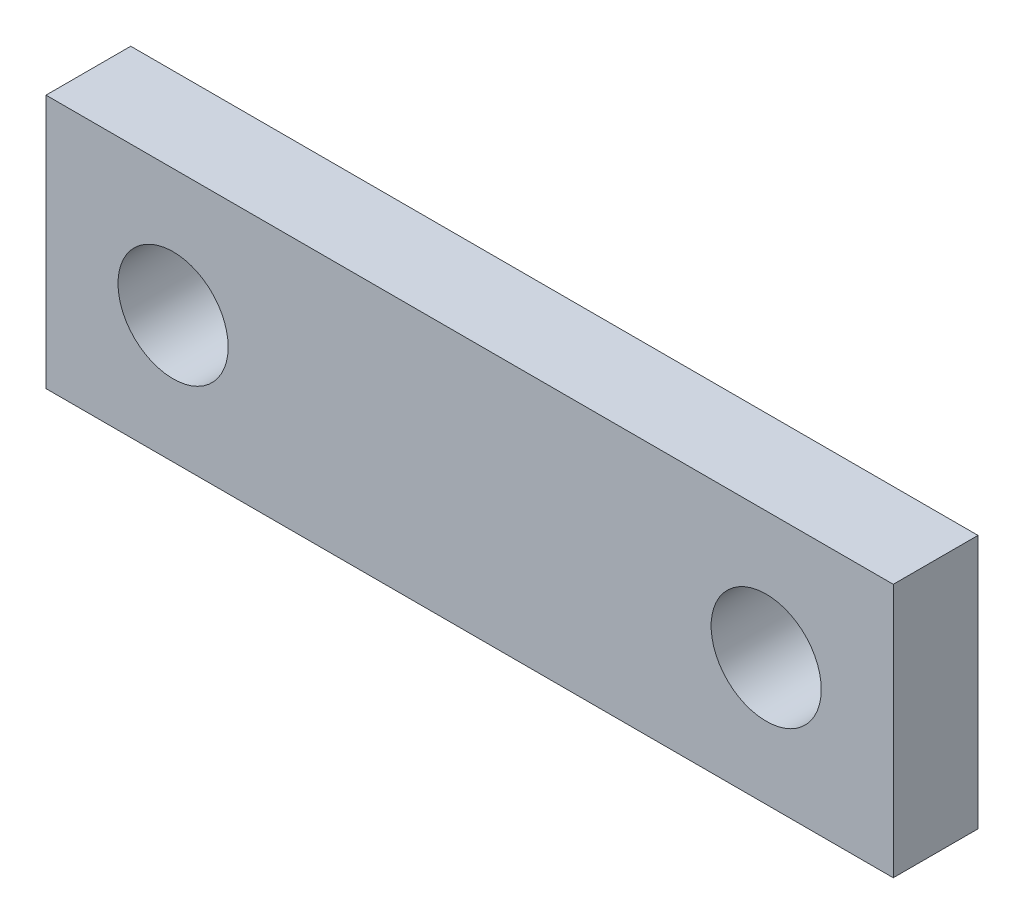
ISO-10303-21;
HEADER;
FILE_DESCRIPTION(('STEP AP214'),'2;1');
FILE_NAME('part.step','',(''),(''),'','','');
FILE_SCHEMA(('AUTOMOTIVE_DESIGN { 1 0 10303 214 1 1 1 1 }'));
ENDSEC;
DATA;
#1=APPLICATION_CONTEXT('core data for automotive mechanical design processes');
#2=APPLICATION_PROTOCOL_DEFINITION('international standard','automotive_design',2000,#1);
#3=PRODUCT_CONTEXT('',#1,'mechanical');
#4=PRODUCT('Part','Part','',(#3));
#5=PRODUCT_RELATED_PRODUCT_CATEGORY('part','',(#4));
#6=PRODUCT_DEFINITION_FORMATION('','',#4);
#7=PRODUCT_DEFINITION_CONTEXT('part definition',#1,'design');
#8=PRODUCT_DEFINITION('design','',#6,#7);
#9=PRODUCT_DEFINITION_SHAPE('','',#8);
#10=(LENGTH_UNIT() NAMED_UNIT(*) SI_UNIT(.MILLI.,.METRE.));
#11=(NAMED_UNIT(*) PLANE_ANGLE_UNIT() SI_UNIT($,.RADIAN.));
#12=(NAMED_UNIT(*) SI_UNIT($,.STERADIAN.) SOLID_ANGLE_UNIT());
#13=UNCERTAINTY_MEASURE_WITH_UNIT(LENGTH_MEASURE(1.E-05),#10,'distance_accuracy_value','');
#14=(GEOMETRIC_REPRESENTATION_CONTEXT(3) GLOBAL_UNCERTAINTY_ASSIGNED_CONTEXT((#13)) GLOBAL_UNIT_ASSIGNED_CONTEXT((#10,
#11,#12)) REPRESENTATION_CONTEXT('',''));
#15=CARTESIAN_POINT('',(0.,0.,0.));
#16=DIRECTION('',(0.,0.,1.));
#17=DIRECTION('',(1.,0.,0.));
#18=AXIS2_PLACEMENT_3D('',#15,#16,#17);
#19=CARTESIAN_POINT('',(-49.9999999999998,14.9999999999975,9.9999999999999));
#20=DIRECTION('',(1.,0.,0.));
#21=DIRECTION('',(0.,0.,-1.));
#22=AXIS2_PLACEMENT_3D('',#19,#20,#21);
#23=PLANE('',#22);
#24=DIRECTION('',(0.,-1.,0.));
#25=VECTOR('',#24,1.);
#26=CARTESIAN_POINT('',(-49.9999999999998,14.9999999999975,0.));
#27=LINE('',#26,#25);
#28=CARTESIAN_POINT('',(-49.9999999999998,14.9999999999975,0.));
#29=VERTEX_POINT('',#28);
#30=CARTESIAN_POINT('',(-49.9999999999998,-15.0000000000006,0.));
#31=VERTEX_POINT('',#30);
#32=EDGE_CURVE('E76',#29,#31,#27,.T.);
#33=ORIENTED_EDGE('',*,*,#32,.T.);
#34=DIRECTION('',(0.,0.,-1.));
#35=VECTOR('',#34,1.);
#36=CARTESIAN_POINT('',(-49.9999999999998,-15.0000000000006,9.99999999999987));
#37=LINE('',#36,#35);
#38=CARTESIAN_POINT('',(-49.9999999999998,-15.0000000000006,9.99999999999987));
#39=VERTEX_POINT('',#38);
#40=EDGE_CURVE('E11',#39,#31,#37,.T.);
#41=ORIENTED_EDGE('',*,*,#40,.F.);
#42=DIRECTION('',(0.,-1.,0.));
#43=VECTOR('',#42,1.);
#44=CARTESIAN_POINT('',(-49.9999999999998,14.9999999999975,9.9999999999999));
#45=LINE('',#44,#43);
#46=CARTESIAN_POINT('',(-49.9999999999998,14.9999999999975,9.9999999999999));
#47=VERTEX_POINT('',#46);
#48=EDGE_CURVE('E99',#47,#39,#45,.T.);
#49=ORIENTED_EDGE('',*,*,#48,.F.);
#50=DIRECTION('',(0.,0.,-1.));
#51=VECTOR('',#50,1.);
#52=CARTESIAN_POINT('',(-49.9999999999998,14.9999999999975,9.9999999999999));
#53=LINE('',#52,#51);
#54=EDGE_CURVE('E88',#47,#29,#53,.T.);
#55=ORIENTED_EDGE('',*,*,#54,.T.);
#56=EDGE_LOOP('',(#33,#41,#49,#55));
#57=FACE_BOUND('',#56,.T.);
#58=ADVANCED_FACE('F32',(#57),#23,.F.);
#59=CARTESIAN_POINT('',(-49.9999999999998,-15.0000000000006,9.99999999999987));
#60=DIRECTION('',(0.,1.,0.));
#61=DIRECTION('',(-1.,0.,0.));
#62=AXIS2_PLACEMENT_3D('',#59,#60,#61);
#63=PLANE('',#62);
#64=DIRECTION('',(1.,0.,0.));
#65=VECTOR('',#64,1.);
#66=CARTESIAN_POINT('',(-49.9999999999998,-15.0000000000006,0.));
#67=LINE('',#66,#65);
#68=CARTESIAN_POINT('',(49.9999999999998,-15.000000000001,-1.11022302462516E-13));
#69=VERTEX_POINT('',#68);
#70=EDGE_CURVE('E72',#31,#69,#67,.T.);
#71=ORIENTED_EDGE('',*,*,#70,.T.);
#72=DIRECTION('',(0.,0.,-1.));
#73=VECTOR('',#72,1.);
#74=CARTESIAN_POINT('',(49.9999999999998,-15.000000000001,9.9999999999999));
#75=LINE('',#74,#73);
#76=CARTESIAN_POINT('',(49.9999999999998,-15.000000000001,9.9999999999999));
#77=VERTEX_POINT('',#76);
#78=EDGE_CURVE('E39',#77,#69,#75,.T.);
#79=ORIENTED_EDGE('',*,*,#78,.F.);
#80=DIRECTION('',(1.,0.,0.));
#81=VECTOR('',#80,1.);
#82=CARTESIAN_POINT('',(-49.9999999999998,-15.0000000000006,9.99999999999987));
#83=LINE('',#82,#81);
#84=EDGE_CURVE('E84',#39,#77,#83,.T.);
#85=ORIENTED_EDGE('',*,*,#84,.F.);
#86=ORIENTED_EDGE('',*,*,#40,.T.);
#87=EDGE_LOOP('',(#71,#79,#85,#86));
#88=FACE_BOUND('',#87,.T.);
#89=ADVANCED_FACE('F83',(#88),#63,.F.);
#90=CARTESIAN_POINT('',(49.9999999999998,14.9999999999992,9.99999999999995));
#91=DIRECTION('',(-1.,0.,0.));
#92=DIRECTION('',(0.,0.,1.));
#93=AXIS2_PLACEMENT_3D('',#90,#91,#92);
#94=PLANE('',#93);
#95=DIRECTION('',(0.,1.,0.));
#96=VECTOR('',#95,1.);
#97=CARTESIAN_POINT('',(49.9999999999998,14.9999999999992,-1.11022302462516E-13));
#98=LINE('',#97,#96);
#99=CARTESIAN_POINT('',(49.9999999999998,14.9999999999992,-1.11022302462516E-13));
#100=VERTEX_POINT('',#99);
#101=EDGE_CURVE('E77',#69,#100,#98,.T.);
#102=ORIENTED_EDGE('',*,*,#101,.T.);
#103=DIRECTION('',(0.,0.,-1.));
#104=VECTOR('',#103,1.);
#105=CARTESIAN_POINT('',(49.9999999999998,14.9999999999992,9.99999999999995));
#106=LINE('',#105,#104);
#107=CARTESIAN_POINT('',(49.9999999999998,14.9999999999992,9.99999999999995));
#108=VERTEX_POINT('',#107);
#109=EDGE_CURVE('E105',#108,#100,#106,.T.);
#110=ORIENTED_EDGE('',*,*,#109,.F.);
#111=DIRECTION('',(0.,1.,0.));
#112=VECTOR('',#111,1.);
#113=CARTESIAN_POINT('',(49.9999999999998,14.9999999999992,9.99999999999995));
#114=LINE('',#113,#112);
#115=EDGE_CURVE('E51',#77,#108,#114,.T.);
#116=ORIENTED_EDGE('',*,*,#115,.F.);
#117=ORIENTED_EDGE('',*,*,#78,.T.);
#118=EDGE_LOOP('',(#102,#110,#116,#117));
#119=FACE_BOUND('',#118,.T.);
#120=ADVANCED_FACE('F108',(#119),#94,.F.);
#121=CARTESIAN_POINT('',(-49.9999999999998,14.9999999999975,9.9999999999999));
#122=DIRECTION('',(0.,-1.,0.));
#123=DIRECTION('',(1.,0.,0.));
#124=AXIS2_PLACEMENT_3D('',#121,#122,#123);
#125=PLANE('',#124);
#126=DIRECTION('',(-1.,0.,0.));
#127=VECTOR('',#126,1.);
#128=CARTESIAN_POINT('',(-49.9999999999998,14.9999999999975,0.));
#129=LINE('',#128,#127);
#130=EDGE_CURVE('E97',#100,#29,#129,.T.);
#131=ORIENTED_EDGE('',*,*,#130,.T.);
#132=ORIENTED_EDGE('',*,*,#54,.F.);
#133=DIRECTION('',(-1.,0.,0.));
#134=VECTOR('',#133,1.);
#135=CARTESIAN_POINT('',(-49.9999999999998,14.9999999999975,9.9999999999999));
#136=LINE('',#135,#134);
#137=EDGE_CURVE('E46',#108,#47,#136,.T.);
#138=ORIENTED_EDGE('',*,*,#137,.F.);
#139=ORIENTED_EDGE('',*,*,#109,.T.);
#140=EDGE_LOOP('',(#131,#132,#138,#139));
#141=FACE_BOUND('',#140,.T.);
#142=ADVANCED_FACE('F110',(#141),#125,.F.);
#143=CARTESIAN_POINT('',(-49.9999999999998,-15.0000000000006,9.99999999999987));
#144=DIRECTION('',(0.,0.,1.));
#145=DIRECTION('',(1.,0.,0.));
#146=AXIS2_PLACEMENT_3D('',#143,#144,#145);
#147=PLANE('',#146);
#148=CARTESIAN_POINT('',(34.9999999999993,-4.44089209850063E-13,9.9999999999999));
#149=DIRECTION('',(0.,0.,1.));
#150=DIRECTION('',(1.,0.,0.));
#151=AXIS2_PLACEMENT_3D('',#148,#149,#150);
#152=CIRCLE('',#151,6.5);
#153=CARTESIAN_POINT('',(41.4999999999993,-4.44089209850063E-13,9.9999999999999));
#154=VERTEX_POINT('',#153);
#155=EDGE_CURVE('E177',#154,#154,#152,.T.);
#156=ORIENTED_EDGE('',*,*,#155,.F.);
#157=EDGE_LOOP('',(#156));
#158=FACE_BOUND('',#157,.T.);
#159=CARTESIAN_POINT('',(-35.0000000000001,-4.44089209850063E-13,9.99999999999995));
#160=DIRECTION('',(0.,0.,1.));
#161=DIRECTION('',(1.,0.,0.));
#162=AXIS2_PLACEMENT_3D('',#159,#160,#161);
#163=CIRCLE('',#162,6.5);
#164=CARTESIAN_POINT('',(-28.5000000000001,-4.44089209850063E-13,9.99999999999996));
#165=VERTEX_POINT('',#164);
#166=EDGE_CURVE('E92',#165,#165,#163,.T.);
#167=ORIENTED_EDGE('',*,*,#166,.F.);
#168=EDGE_LOOP('',(#167));
#169=FACE_BOUND('',#168,.T.);
#170=ORIENTED_EDGE('',*,*,#48,.T.);
#171=ORIENTED_EDGE('',*,*,#84,.T.);
#172=ORIENTED_EDGE('',*,*,#115,.T.);
#173=ORIENTED_EDGE('',*,*,#137,.T.);
#174=EDGE_LOOP('',(#170,#171,#172,#173));
#175=FACE_BOUND('',#174,.T.);
#176=ADVANCED_FACE('F111',(#158,#169,#175),#147,.T.);
#177=CARTESIAN_POINT('',(-49.9999999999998,-15.0000000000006,0.));
#178=DIRECTION('',(0.,0.,1.));
#179=DIRECTION('',(1.,0.,0.));
#180=AXIS2_PLACEMENT_3D('',#177,#178,#179);
#181=PLANE('',#180);
#182=CARTESIAN_POINT('',(34.9999999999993,-4.44089209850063E-13,-1.11022302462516E-13));
#183=DIRECTION('',(0.,0.,1.));
#184=DIRECTION('',(1.,0.,0.));
#185=AXIS2_PLACEMENT_3D('',#182,#183,#184);
#186=CIRCLE('',#185,6.5);
#187=CARTESIAN_POINT('',(41.4999999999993,-4.44089209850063E-13,-1.11022302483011E-13));
#188=VERTEX_POINT('',#187);
#189=EDGE_CURVE('E175',#188,#188,#186,.T.);
#190=ORIENTED_EDGE('',*,*,#189,.T.);
#191=EDGE_LOOP('',(#190));
#192=FACE_BOUND('',#191,.T.);
#193=CARTESIAN_POINT('',(-35.0000000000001,-4.44089209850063E-13,0.));
#194=DIRECTION('',(0.,0.,1.));
#195=DIRECTION('',(1.,0.,0.));
#196=AXIS2_PLACEMENT_3D('',#193,#194,#195);
#197=CIRCLE('',#196,6.5);
#198=CARTESIAN_POINT('',(-28.5000000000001,-4.44089209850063E-13,0.));
#199=VERTEX_POINT('',#198);
#200=EDGE_CURVE('E89',#199,#199,#197,.T.);
#201=ORIENTED_EDGE('',*,*,#200,.T.);
#202=EDGE_LOOP('',(#201));
#203=FACE_BOUND('',#202,.T.);
#204=ORIENTED_EDGE('',*,*,#32,.F.);
#205=ORIENTED_EDGE('',*,*,#130,.F.);
#206=ORIENTED_EDGE('',*,*,#101,.F.);
#207=ORIENTED_EDGE('',*,*,#70,.F.);
#208=EDGE_LOOP('',(#204,#205,#206,#207));
#209=FACE_BOUND('',#208,.T.);
#210=ADVANCED_FACE('F73',(#192,#203,#209),#181,.F.);
#211=CARTESIAN_POINT('',(-35.0000000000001,-4.44089209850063E-13,0.));
#212=DIRECTION('',(0.,0.,1.));
#213=DIRECTION('',(1.,0.,0.));
#214=AXIS2_PLACEMENT_3D('',#211,#212,#213);
#215=CYLINDRICAL_SURFACE('',#214,6.5);
#216=CARTESIAN_POINT('',(-28.5000000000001,-4.44089209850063E-13,0.));
#217=CARTESIAN_POINT('',(-28.5000000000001,-4.44089209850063E-13,0.104166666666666));
#218=CARTESIAN_POINT('',(-28.5000000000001,-4.44089209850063E-13,0.208333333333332));
#219=CARTESIAN_POINT('',(-28.5000000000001,-4.44089209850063E-13,0.416666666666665));
#220=CARTESIAN_POINT('',(-28.5000000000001,-4.44089209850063E-13,0.520833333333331));
#221=CARTESIAN_POINT('',(-28.5000000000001,-4.44089209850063E-13,0.729166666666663));
#222=CARTESIAN_POINT('',(-28.5000000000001,-4.44089209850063E-13,0.83333333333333));
#223=CARTESIAN_POINT('',(-28.5000000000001,-4.44089209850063E-13,1.04166666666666));
#224=CARTESIAN_POINT('',(-28.5000000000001,-4.44089209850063E-13,1.14583333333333));
#225=CARTESIAN_POINT('',(-28.5000000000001,-4.44089209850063E-13,1.35416666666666));
#226=CARTESIAN_POINT('',(-28.5000000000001,-4.44089209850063E-13,1.45833333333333));
#227=CARTESIAN_POINT('',(-28.5000000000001,-4.44089209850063E-13,1.66666666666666));
#228=CARTESIAN_POINT('',(-28.5000000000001,-4.44089209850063E-13,1.77083333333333));
#229=CARTESIAN_POINT('',(-28.5000000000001,-4.44089209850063E-13,1.97916666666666));
#230=CARTESIAN_POINT('',(-28.5000000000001,-4.44089209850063E-13,2.08333333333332));
#231=CARTESIAN_POINT('',(-28.5000000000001,-4.44089209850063E-13,2.29166666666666));
#232=CARTESIAN_POINT('',(-28.5000000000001,-4.44089209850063E-13,2.39583333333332));
#233=CARTESIAN_POINT('',(-28.5000000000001,-4.44089209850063E-13,2.60416666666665));
#234=CARTESIAN_POINT('',(-28.5000000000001,-4.44089209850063E-13,2.70833333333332));
#235=CARTESIAN_POINT('',(-28.5000000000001,-4.44089209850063E-13,2.91666666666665));
#236=CARTESIAN_POINT('',(-28.5000000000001,-4.44089209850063E-13,3.02083333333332));
#237=CARTESIAN_POINT('',(-28.5000000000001,-4.44089209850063E-13,3.22916666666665));
#238=CARTESIAN_POINT('',(-28.5000000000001,-4.44089209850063E-13,3.33333333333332));
#239=CARTESIAN_POINT('',(-28.5000000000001,-4.44089209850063E-13,3.54166666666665));
#240=CARTESIAN_POINT('',(-28.5000000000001,-4.44089209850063E-13,3.64583333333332));
#241=CARTESIAN_POINT('',(-28.5000000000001,-4.44089209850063E-13,3.85416666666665));
#242=CARTESIAN_POINT('',(-28.5000000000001,-4.44089209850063E-13,3.95833333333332));
#243=CARTESIAN_POINT('',(-28.5000000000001,-4.44089209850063E-13,4.16666666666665));
#244=CARTESIAN_POINT('',(-28.5000000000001,-4.44089209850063E-13,4.27083333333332));
#245=CARTESIAN_POINT('',(-28.5000000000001,-4.44089209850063E-13,4.47916666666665));
#246=CARTESIAN_POINT('',(-28.5000000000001,-4.44089209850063E-13,4.58333333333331));
#247=CARTESIAN_POINT('',(-28.5000000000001,-4.44089209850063E-13,4.79166666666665));
#248=CARTESIAN_POINT('',(-28.5000000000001,-4.44089209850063E-13,4.89583333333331));
#249=CARTESIAN_POINT('',(-28.5000000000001,-4.44089209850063E-13,5.10416666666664));
#250=CARTESIAN_POINT('',(-28.5000000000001,-4.44089209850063E-13,5.20833333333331));
#251=CARTESIAN_POINT('',(-28.5000000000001,-4.44089209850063E-13,5.41666666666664));
#252=CARTESIAN_POINT('',(-28.5000000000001,-4.44089209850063E-13,5.52083333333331));
#253=CARTESIAN_POINT('',(-28.5000000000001,-4.44089209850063E-13,5.72916666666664));
#254=CARTESIAN_POINT('',(-28.5000000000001,-4.44089209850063E-13,5.83333333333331));
#255=CARTESIAN_POINT('',(-28.5000000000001,-4.44089209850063E-13,6.04166666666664));
#256=CARTESIAN_POINT('',(-28.5000000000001,-4.44089209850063E-13,6.14583333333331));
#257=CARTESIAN_POINT('',(-28.5000000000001,-4.44089209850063E-13,6.35416666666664));
#258=CARTESIAN_POINT('',(-28.5000000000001,-4.44089209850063E-13,6.4583333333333));
#259=CARTESIAN_POINT('',(-28.5000000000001,-4.44089209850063E-13,6.66666666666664));
#260=CARTESIAN_POINT('',(-28.5000000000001,-4.44089209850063E-13,6.7708333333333));
#261=CARTESIAN_POINT('',(-28.5000000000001,-4.44089209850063E-13,6.97916666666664));
#262=CARTESIAN_POINT('',(-28.5000000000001,-4.44089209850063E-13,7.0833333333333));
#263=CARTESIAN_POINT('',(-28.5000000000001,-4.44089209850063E-13,7.29166666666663));
#264=CARTESIAN_POINT('',(-28.5000000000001,-4.44089209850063E-13,7.3958333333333));
#265=CARTESIAN_POINT('',(-28.5000000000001,-4.44089209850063E-13,7.60416666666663));
#266=CARTESIAN_POINT('',(-28.5000000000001,-4.44089209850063E-13,7.7083333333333));
#267=CARTESIAN_POINT('',(-28.5000000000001,-4.44089209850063E-13,7.91666666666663));
#268=CARTESIAN_POINT('',(-28.5000000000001,-4.44089209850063E-13,8.0208333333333));
#269=CARTESIAN_POINT('',(-28.5000000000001,-4.44089209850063E-13,8.22916666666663));
#270=CARTESIAN_POINT('',(-28.5000000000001,-4.44089209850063E-13,8.3333333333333));
#271=CARTESIAN_POINT('',(-28.5000000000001,-4.44089209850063E-13,8.54166666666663));
#272=CARTESIAN_POINT('',(-28.5000000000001,-4.44089209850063E-13,8.64583333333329));
#273=CARTESIAN_POINT('',(-28.5000000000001,-4.44089209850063E-13,8.85416666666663));
#274=CARTESIAN_POINT('',(-28.5000000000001,-4.44089209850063E-13,8.95833333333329));
#275=CARTESIAN_POINT('',(-28.5000000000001,-4.44089209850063E-13,9.16666666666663));
#276=CARTESIAN_POINT('',(-28.5000000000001,-4.44089209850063E-13,9.27083333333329));
#277=CARTESIAN_POINT('',(-28.5000000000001,-4.44089209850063E-13,9.47916666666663));
#278=CARTESIAN_POINT('',(-28.5000000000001,-4.44089209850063E-13,9.58333333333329));
#279=CARTESIAN_POINT('',(-28.5000000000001,-4.44089209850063E-13,9.79166666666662));
#280=CARTESIAN_POINT('',(-28.5000000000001,-4.44089209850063E-13,9.89583333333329));
#281=CARTESIAN_POINT('',(-28.5000000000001,-4.44089209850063E-13,9.99999999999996));
#282=B_SPLINE_CURVE_WITH_KNOTS('',3,(#216,#217,#218,#219,#220,#221,#222,#223,#224,#225,#226,
#227,#228,#229,#230,#231,#232,#233,#234,#235,#236,#237,#238,#239,#240,#241,#242,#243,#244,#245,
#246,#247,#248,#249,#250,#251,#252,#253,#254,#255,#256,#257,#258,#259,#260,#261,#262,#263,#264,
#265,#266,#267,#268,#269,#270,#271,#272,#273,#274,#275,#276,#277,#278,#279,#280,#281),
.UNSPECIFIED.,.F.,.F.,(4,2,2,2,2,2,2,2,2,2,2,2,2,2,2,2,2,2,2,2,2,2,2,2,2,2,2,2,2,2,2,2,4),(0.,
0.312499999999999,0.624999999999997,0.937499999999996,1.24999999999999,1.56249999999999,
1.87499999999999,2.18749999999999,2.49999999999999,2.81249999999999,3.12499999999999,
3.43749999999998,3.74999999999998,4.06249999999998,4.37499999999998,4.68749999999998,
4.99999999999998,5.31249999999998,5.62499999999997,5.93749999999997,6.24999999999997,
6.56249999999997,6.87499999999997,7.18749999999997,7.49999999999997,7.81249999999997,
8.12499999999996,8.43749999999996,8.74999999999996,9.06249999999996,9.37499999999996,
9.68749999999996,9.99999999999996),.UNSPECIFIED.);
#283=EDGE_CURVE('BSEAM119',#199,#165,#282,.T.);
#284=ORIENTED_EDGE('',*,*,#200,.F.);
#285=ORIENTED_EDGE('',*,*,#166,.T.);
#286=ORIENTED_EDGE('',*,*,#283,.T.);
#287=ORIENTED_EDGE('',*,*,#283,.F.);
#288=EDGE_LOOP('',(#284,#286,#285,#287));
#289=FACE_BOUND('',#288,.T.);
#290=ADVANCED_FACE('F119',(#289),#215,.F.);
#291=CARTESIAN_POINT('',(34.9999999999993,-4.44089209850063E-13,-1.11022302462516E-13));
#292=DIRECTION('',(0.,0.,1.));
#293=DIRECTION('',(1.,0.,0.));
#294=AXIS2_PLACEMENT_3D('',#291,#292,#293);
#295=CYLINDRICAL_SURFACE('',#294,6.5);
#296=CARTESIAN_POINT('',(41.4999999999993,-4.44089209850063E-13,-1.11022302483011E-13));
#297=CARTESIAN_POINT('',(41.4999999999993,-4.44089209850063E-13,0.104166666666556));
#298=CARTESIAN_POINT('',(41.4999999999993,-4.44089209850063E-13,0.208333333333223));
#299=CARTESIAN_POINT('',(41.4999999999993,-4.44089209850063E-13,0.416666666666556));
#300=CARTESIAN_POINT('',(41.4999999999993,-4.44089209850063E-13,0.520833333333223));
#301=CARTESIAN_POINT('',(41.4999999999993,-4.44089209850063E-13,0.729166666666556));
#302=CARTESIAN_POINT('',(41.4999999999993,-4.44089209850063E-13,0.833333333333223));
#303=CARTESIAN_POINT('',(41.4999999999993,-4.44089209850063E-13,1.04166666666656));
#304=CARTESIAN_POINT('',(41.4999999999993,-4.44089209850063E-13,1.14583333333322));
#305=CARTESIAN_POINT('',(41.4999999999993,-4.44089209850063E-13,1.35416666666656));
#306=CARTESIAN_POINT('',(41.4999999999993,-4.44089209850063E-13,1.45833333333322));
#307=CARTESIAN_POINT('',(41.4999999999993,-4.44089209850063E-13,1.66666666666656));
#308=CARTESIAN_POINT('',(41.4999999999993,-4.44089209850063E-13,1.77083333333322));
#309=CARTESIAN_POINT('',(41.4999999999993,-4.44089209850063E-13,1.97916666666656));
#310=CARTESIAN_POINT('',(41.4999999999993,-4.44089209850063E-13,2.08333333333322));
#311=CARTESIAN_POINT('',(41.4999999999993,-4.44089209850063E-13,2.29166666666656));
#312=CARTESIAN_POINT('',(41.4999999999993,-4.44089209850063E-13,2.39583333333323));
#313=CARTESIAN_POINT('',(41.4999999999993,-4.44089209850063E-13,2.60416666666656));
#314=CARTESIAN_POINT('',(41.4999999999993,-4.44089209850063E-13,2.70833333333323));
#315=CARTESIAN_POINT('',(41.4999999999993,-4.44089209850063E-13,2.91666666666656));
#316=CARTESIAN_POINT('',(41.4999999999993,-4.44089209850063E-13,3.02083333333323));
#317=CARTESIAN_POINT('',(41.4999999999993,-4.44089209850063E-13,3.22916666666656));
#318=CARTESIAN_POINT('',(41.4999999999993,-4.44089209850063E-13,3.33333333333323));
#319=CARTESIAN_POINT('',(41.4999999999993,-4.44089209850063E-13,3.54166666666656));
#320=CARTESIAN_POINT('',(41.4999999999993,-4.44089209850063E-13,3.64583333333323));
#321=CARTESIAN_POINT('',(41.4999999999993,-4.44089209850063E-13,3.85416666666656));
#322=CARTESIAN_POINT('',(41.4999999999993,-4.44089209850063E-13,3.95833333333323));
#323=CARTESIAN_POINT('',(41.4999999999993,-4.44089209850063E-13,4.16666666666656));
#324=CARTESIAN_POINT('',(41.4999999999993,-4.44089209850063E-13,4.27083333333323));
#325=CARTESIAN_POINT('',(41.4999999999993,-4.44089209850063E-13,4.47916666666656));
#326=CARTESIAN_POINT('',(41.4999999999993,-4.44089209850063E-13,4.58333333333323));
#327=CARTESIAN_POINT('',(41.4999999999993,-4.44089209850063E-13,4.79166666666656));
#328=CARTESIAN_POINT('',(41.4999999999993,-4.44089209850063E-13,4.89583333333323));
#329=CARTESIAN_POINT('',(41.4999999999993,-4.44089209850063E-13,5.10416666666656));
#330=CARTESIAN_POINT('',(41.4999999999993,-4.44089209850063E-13,5.20833333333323));
#331=CARTESIAN_POINT('',(41.4999999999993,-4.44089209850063E-13,5.41666666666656));
#332=CARTESIAN_POINT('',(41.4999999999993,-4.44089209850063E-13,5.52083333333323));
#333=CARTESIAN_POINT('',(41.4999999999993,-4.44089209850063E-13,5.72916666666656));
#334=CARTESIAN_POINT('',(41.4999999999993,-4.44089209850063E-13,5.83333333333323));
#335=CARTESIAN_POINT('',(41.4999999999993,-4.44089209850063E-13,6.04166666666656));
#336=CARTESIAN_POINT('',(41.4999999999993,-4.44089209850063E-13,6.14583333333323));
#337=CARTESIAN_POINT('',(41.4999999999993,-4.44089209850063E-13,6.35416666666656));
#338=CARTESIAN_POINT('',(41.4999999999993,-4.44089209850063E-13,6.45833333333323));
#339=CARTESIAN_POINT('',(41.4999999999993,-4.44089209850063E-13,6.66666666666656));
#340=CARTESIAN_POINT('',(41.4999999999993,-4.44089209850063E-13,6.77083333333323));
#341=CARTESIAN_POINT('',(41.4999999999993,-4.44089209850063E-13,6.97916666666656));
#342=CARTESIAN_POINT('',(41.4999999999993,-4.44089209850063E-13,7.08333333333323));
#343=CARTESIAN_POINT('',(41.4999999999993,-4.44089209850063E-13,7.29166666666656));
#344=CARTESIAN_POINT('',(41.4999999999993,-4.44089209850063E-13,7.39583333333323));
#345=CARTESIAN_POINT('',(41.4999999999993,-4.44089209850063E-13,7.60416666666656));
#346=CARTESIAN_POINT('',(41.4999999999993,-4.44089209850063E-13,7.70833333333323));
#347=CARTESIAN_POINT('',(41.4999999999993,-4.44089209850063E-13,7.91666666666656));
#348=CARTESIAN_POINT('',(41.4999999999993,-4.44089209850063E-13,8.02083333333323));
#349=CARTESIAN_POINT('',(41.4999999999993,-4.44089209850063E-13,8.22916666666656));
#350=CARTESIAN_POINT('',(41.4999999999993,-4.44089209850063E-13,8.33333333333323));
#351=CARTESIAN_POINT('',(41.4999999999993,-4.44089209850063E-13,8.54166666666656));
#352=CARTESIAN_POINT('',(41.4999999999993,-4.44089209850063E-13,8.64583333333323));
#353=CARTESIAN_POINT('',(41.4999999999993,-4.44089209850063E-13,8.85416666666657));
#354=CARTESIAN_POINT('',(41.4999999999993,-4.44089209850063E-13,8.95833333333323));
#355=CARTESIAN_POINT('',(41.4999999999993,-4.44089209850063E-13,9.16666666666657));
#356=CARTESIAN_POINT('',(41.4999999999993,-4.44089209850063E-13,9.27083333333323));
#357=CARTESIAN_POINT('',(41.4999999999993,-4.44089209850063E-13,9.47916666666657));
#358=CARTESIAN_POINT('',(41.4999999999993,-4.44089209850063E-13,9.58333333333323));
#359=CARTESIAN_POINT('',(41.4999999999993,-4.44089209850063E-13,9.79166666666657));
#360=CARTESIAN_POINT('',(41.4999999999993,-4.44089209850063E-13,9.89583333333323));
#361=CARTESIAN_POINT('',(41.4999999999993,-4.44089209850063E-13,9.9999999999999));
#362=B_SPLINE_CURVE_WITH_KNOTS('',3,(#296,#297,#298,#299,#300,#301,#302,#303,#304,#305,#306,
#307,#308,#309,#310,#311,#312,#313,#314,#315,#316,#317,#318,#319,#320,#321,#322,#323,#324,#325,
#326,#327,#328,#329,#330,#331,#332,#333,#334,#335,#336,#337,#338,#339,#340,#341,#342,#343,#344,
#345,#346,#347,#348,#349,#350,#351,#352,#353,#354,#355,#356,#357,#358,#359,#360,#361),
.UNSPECIFIED.,.F.,.F.,(4,2,2,2,2,2,2,2,2,2,2,2,2,2,2,2,2,2,2,2,2,2,2,2,2,2,2,2,2,2,2,2,4),(0.,
0.3125,0.625000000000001,0.937500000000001,1.25,1.5625,1.875,2.1875,2.5,2.8125,3.125,3.4375,
3.75,4.0625,4.37500000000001,4.68750000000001,5.00000000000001,5.31250000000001,
5.62500000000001,5.93750000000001,6.25000000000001,6.56250000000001,6.87500000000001,
7.18750000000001,7.50000000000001,7.81250000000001,8.12500000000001,8.43750000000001,
8.75000000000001,9.06250000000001,9.37500000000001,9.68750000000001,10.),.UNSPECIFIED.);
#363=EDGE_CURVE('BSEAM158',#188,#154,#362,.T.);
#364=ORIENTED_EDGE('',*,*,#189,.F.);
#365=ORIENTED_EDGE('',*,*,#155,.T.);
#366=ORIENTED_EDGE('',*,*,#363,.T.);
#367=ORIENTED_EDGE('',*,*,#363,.F.);
#368=EDGE_LOOP('',(#364,#366,#365,#367));
#369=FACE_BOUND('',#368,.T.);
#370=ADVANCED_FACE('F158',(#369),#295,.F.);
#371=CLOSED_SHELL('',(#58,#89,#120,#142,#176,#210,#290,#370));
#372=MANIFOLD_SOLID_BREP('B2',#371);
#373=ADVANCED_BREP_SHAPE_REPRESENTATION('',(#18,#372),#14);
#374=SHAPE_DEFINITION_REPRESENTATION(#9,#373);
ENDSEC;
END-ISO-10303-21;
